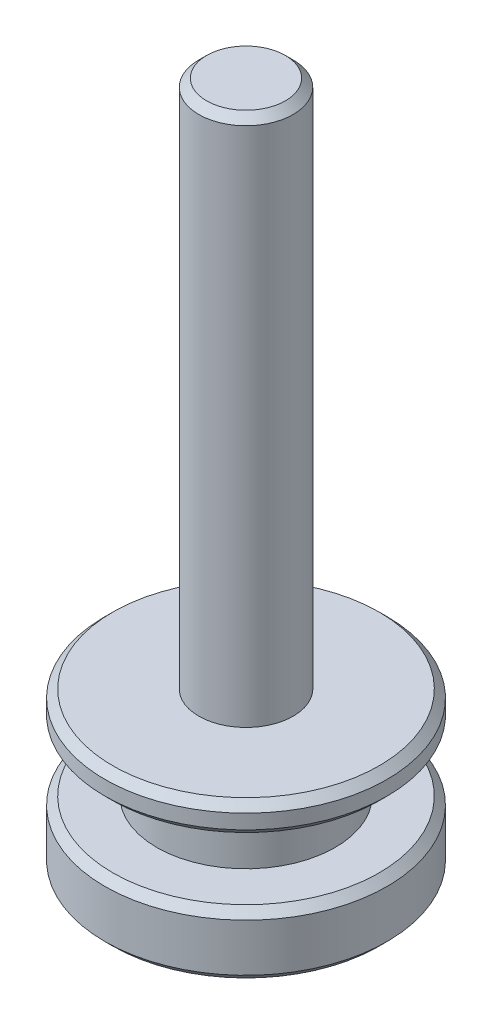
ISO-10303-21;
HEADER;
FILE_DESCRIPTION(('STEP AP214'),'2;1');
FILE_NAME('part.step','',(''),(''),'','','');
FILE_SCHEMA(('AUTOMOTIVE_DESIGN { 1 0 10303 214 1 1 1 1 }'));
ENDSEC;
DATA;
#1=APPLICATION_CONTEXT('core data for automotive mechanical design processes');
#2=APPLICATION_PROTOCOL_DEFINITION('international standard','automotive_design',2000,#1);
#3=PRODUCT_CONTEXT('',#1,'mechanical');
#4=PRODUCT('Part','Part','',(#3));
#5=PRODUCT_RELATED_PRODUCT_CATEGORY('part','',(#4));
#6=PRODUCT_DEFINITION_FORMATION('','',#4);
#7=PRODUCT_DEFINITION_CONTEXT('part definition',#1,'design');
#8=PRODUCT_DEFINITION('design','',#6,#7);
#9=PRODUCT_DEFINITION_SHAPE('','',#8);
#10=(LENGTH_UNIT() NAMED_UNIT(*) SI_UNIT(.MILLI.,.METRE.));
#11=(NAMED_UNIT(*) PLANE_ANGLE_UNIT() SI_UNIT($,.RADIAN.));
#12=(NAMED_UNIT(*) SI_UNIT($,.STERADIAN.) SOLID_ANGLE_UNIT());
#13=UNCERTAINTY_MEASURE_WITH_UNIT(LENGTH_MEASURE(1.E-05),#10,'distance_accuracy_value','');
#14=(GEOMETRIC_REPRESENTATION_CONTEXT(3) GLOBAL_UNCERTAINTY_ASSIGNED_CONTEXT((#13)) GLOBAL_UNIT_ASSIGNED_CONTEXT((#10,
#11,#12)) REPRESENTATION_CONTEXT('',''));
#15=CARTESIAN_POINT('',(0.,0.,0.));
#16=DIRECTION('',(0.,0.,1.));
#17=DIRECTION('',(1.,0.,0.));
#18=AXIS2_PLACEMENT_3D('',#15,#16,#17);
#19=CARTESIAN_POINT('',(0.,7.874,0.));
#20=DIRECTION('',(0.,1.,0.));
#21=DIRECTION('',(0.,0.,1.));
#22=AXIS2_PLACEMENT_3D('',#19,#20,#21);
#23=PLANE('',#22);
#24=CARTESIAN_POINT('',(0.,7.874,0.));
#25=DIRECTION('',(0.,1.,0.));
#26=DIRECTION('',(0.,0.,1.));
#27=AXIS2_PLACEMENT_3D('',#24,#25,#26);
#28=CIRCLE('',#27,6.71512500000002);
#29=CARTESIAN_POINT('',(0.,7.874,-6.71512500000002));
#30=VERTEX_POINT('',#29);
#31=EDGE_CURVE('E41',#30,#30,#28,.T.);
#32=ORIENTED_EDGE('',*,*,#31,.T.);
#33=EDGE_LOOP('',(#32));
#34=FACE_BOUND('',#33,.T.);
#35=CARTESIAN_POINT('',(0.,7.874,0.));
#36=DIRECTION('',(0.,1.,0.));
#37=DIRECTION('',(0.,0.,1.));
#38=AXIS2_PLACEMENT_3D('',#35,#36,#37);
#39=CIRCLE('',#38,2.38125);
#40=CARTESIAN_POINT('',(0.,7.874,2.38125));
#41=VERTEX_POINT('',#40);
#42=EDGE_CURVE('E72',#41,#41,#39,.T.);
#43=ORIENTED_EDGE('',*,*,#42,.F.);
#44=EDGE_LOOP('',(#43));
#45=FACE_BOUND('',#44,.T.);
#46=ADVANCED_FACE('F30',(#34,#45),#23,.T.);
#47=CARTESIAN_POINT('',(0.,3.2004,0.));
#48=DIRECTION('',(0.,1.,0.));
#49=DIRECTION('',(0.,0.,1.));
#50=AXIS2_PLACEMENT_3D('',#47,#48,#49);
#51=PLANE('',#50);
#52=CARTESIAN_POINT('',(0.,3.2004,0.));
#53=DIRECTION('',(0.,1.,0.));
#54=DIRECTION('',(0.,0.,1.));
#55=AXIS2_PLACEMENT_3D('',#52,#53,#54);
#56=CIRCLE('',#55,6.71512500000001);
#57=CARTESIAN_POINT('',(0.,3.2004,6.71512500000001));
#58=VERTEX_POINT('',#57);
#59=EDGE_CURVE('E56',#58,#58,#56,.T.);
#60=ORIENTED_EDGE('',*,*,#59,.T.);
#61=EDGE_LOOP('',(#60));
#62=FACE_BOUND('',#61,.T.);
#63=CARTESIAN_POINT('',(0.,3.2004,0.));
#64=DIRECTION('',(0.,1.,0.));
#65=DIRECTION('',(0.,0.,1.));
#66=AXIS2_PLACEMENT_3D('',#63,#64,#65);
#67=CIRCLE('',#66,4.5);
#68=CARTESIAN_POINT('',(0.,3.2004,4.5));
#69=VERTEX_POINT('',#68);
#70=EDGE_CURVE('E69',#69,#69,#67,.T.);
#71=ORIENTED_EDGE('',*,*,#70,.F.);
#72=EDGE_LOOP('',(#71));
#73=FACE_BOUND('',#72,.T.);
#74=ADVANCED_FACE('F81',(#62,#73),#51,.T.);
#75=CARTESIAN_POINT('',(0.,3.2004,0.));
#76=DIRECTION('',(0.,-1.,0.));
#77=DIRECTION('',(0.,0.,-1.));
#78=AXIS2_PLACEMENT_3D('',#75,#76,#77);
#79=CYLINDRICAL_SURFACE('',#78,7.112);
#80=CARTESIAN_POINT('',(0.,0.396874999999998,0.));
#81=DIRECTION('',(0.,1.,0.));
#82=DIRECTION('',(0.,0.,1.));
#83=AXIS2_PLACEMENT_3D('',#80,#81,#82);
#84=CIRCLE('',#83,7.112);
#85=CARTESIAN_POINT('',(0.,0.396874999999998,7.112));
#86=VERTEX_POINT('',#85);
#87=EDGE_CURVE('E62',#86,#86,#84,.T.);
#88=ORIENTED_EDGE('',*,*,#87,.T.);
#89=EDGE_LOOP('',(#88));
#90=FACE_BOUND('',#89,.T.);
#91=CARTESIAN_POINT('',(0.,2.803525,0.));
#92=DIRECTION('',(0.,1.,0.));
#93=DIRECTION('',(0.,0.,1.));
#94=AXIS2_PLACEMENT_3D('',#91,#92,#93);
#95=CIRCLE('',#94,7.112);
#96=CARTESIAN_POINT('',(0.,2.803525,7.112));
#97=VERTEX_POINT('',#96);
#98=EDGE_CURVE('E65',#97,#97,#95,.F.);
#99=ORIENTED_EDGE('',*,*,#98,.T.);
#100=EDGE_LOOP('',(#99));
#101=FACE_BOUND('',#100,.T.);
#102=ADVANCED_FACE('F87',(#90,#101),#79,.T.);
#103=CARTESIAN_POINT('',(0.,0.,0.));
#104=DIRECTION('',(0.,1.,0.));
#105=DIRECTION('',(0.,0.,1.));
#106=AXIS2_PLACEMENT_3D('',#103,#104,#105);
#107=PLANE('',#106);
#108=CARTESIAN_POINT('',(0.,0.,0.));
#109=DIRECTION('',(0.,1.,0.));
#110=DIRECTION('',(0.,0.,1.));
#111=AXIS2_PLACEMENT_3D('',#108,#109,#110);
#112=CIRCLE('',#111,6.715125);
#113=CARTESIAN_POINT('',(0.,0.,6.715125));
#114=VERTEX_POINT('',#113);
#115=EDGE_CURVE('E59',#114,#114,#112,.F.);
#116=ORIENTED_EDGE('',*,*,#115,.T.);
#117=EDGE_LOOP('',(#116));
#118=FACE_BOUND('',#117,.T.);
#119=ADVANCED_FACE('F103',(#118),#107,.F.);
#120=CARTESIAN_POINT('',(0.,6.35,0.));
#121=DIRECTION('',(0.,-1.,0.));
#122=DIRECTION('',(0.,0.,-1.));
#123=AXIS2_PLACEMENT_3D('',#120,#121,#122);
#124=CYLINDRICAL_SURFACE('',#123,4.5);
#125=CARTESIAN_POINT('',(0.,6.35,0.));
#126=DIRECTION('',(0.,1.,0.));
#127=DIRECTION('',(0.,0.,1.));
#128=AXIS2_PLACEMENT_3D('',#125,#126,#127);
#129=CIRCLE('',#128,4.5);
#130=CARTESIAN_POINT('',(0.,6.35,4.5));
#131=VERTEX_POINT('',#130);
#132=EDGE_CURVE('E68',#131,#131,#129,.T.);
#133=ORIENTED_EDGE('',*,*,#132,.F.);
#134=EDGE_LOOP('',(#133));
#135=FACE_BOUND('',#134,.T.);
#136=ORIENTED_EDGE('',*,*,#70,.T.);
#137=EDGE_LOOP('',(#136));
#138=FACE_BOUND('',#137,.T.);
#139=ADVANCED_FACE('F97',(#135,#138),#124,.T.);
#140=CARTESIAN_POINT('',(0.,6.35,0.));
#141=DIRECTION('',(0.,1.,0.));
#142=DIRECTION('',(0.,0.,1.));
#143=AXIS2_PLACEMENT_3D('',#140,#141,#142);
#144=PLANE('',#143);
#145=CARTESIAN_POINT('',(0.,6.35,0.));
#146=DIRECTION('',(0.,1.,0.));
#147=DIRECTION('',(0.,0.,1.));
#148=AXIS2_PLACEMENT_3D('',#145,#146,#147);
#149=CIRCLE('',#148,6.71512499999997);
#150=CARTESIAN_POINT('',(0.,6.35,6.71512499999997));
#151=VERTEX_POINT('',#150);
#152=EDGE_CURVE('E45',#151,#151,#149,.F.);
#153=ORIENTED_EDGE('',*,*,#152,.T.);
#154=EDGE_LOOP('',(#153));
#155=FACE_BOUND('',#154,.T.);
#156=ORIENTED_EDGE('',*,*,#132,.T.);
#157=EDGE_LOOP('',(#156));
#158=FACE_BOUND('',#157,.T.);
#159=ADVANCED_FACE('F93',(#155,#158),#144,.F.);
#160=CARTESIAN_POINT('',(0.,7.874,0.));
#161=DIRECTION('',(0.,-1.,0.));
#162=DIRECTION('',(0.,0.,-1.));
#163=AXIS2_PLACEMENT_3D('',#160,#161,#162);
#164=CYLINDRICAL_SURFACE('',#163,7.112);
#165=CARTESIAN_POINT('',(0.,6.74687500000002,0.));
#166=DIRECTION('',(0.,1.,0.));
#167=DIRECTION('',(0.,0.,1.));
#168=AXIS2_PLACEMENT_3D('',#165,#166,#167);
#169=CIRCLE('',#168,7.112);
#170=CARTESIAN_POINT('',(0.,6.74687500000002,-7.112));
#171=VERTEX_POINT('',#170);
#172=EDGE_CURVE('E50',#171,#171,#169,.T.);
#173=CARTESIAN_POINT('',(0.,7.47712500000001,0.));
#174=DIRECTION('',(0.,1.,0.));
#175=DIRECTION('',(0.,0.,1.));
#176=AXIS2_PLACEMENT_3D('',#173,#174,#175);
#177=CIRCLE('',#176,7.112);
#178=CARTESIAN_POINT('',(0.,7.47712500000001,-7.112));
#179=VERTEX_POINT('',#178);
#180=EDGE_CURVE('E53',#179,#179,#177,.F.);
#181=CARTESIAN_POINT('',(0.,6.74687500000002,-7.112));
#182=CARTESIAN_POINT('',(0.,6.75448177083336,-7.112));
#183=CARTESIAN_POINT('',(0.,6.76208854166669,-7.112));
#184=CARTESIAN_POINT('',(0.,6.77730208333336,-7.112));
#185=CARTESIAN_POINT('',(0.,6.78490885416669,-7.112));
#186=CARTESIAN_POINT('',(0.,6.80012239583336,-7.112));
#187=CARTESIAN_POINT('',(0.,6.80772916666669,-7.112));
#188=CARTESIAN_POINT('',(0.,6.82294270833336,-7.112));
#189=CARTESIAN_POINT('',(0.,6.83054947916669,-7.112));
#190=CARTESIAN_POINT('',(0.,6.84576302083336,-7.112));
#191=CARTESIAN_POINT('',(0.,6.85336979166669,-7.112));
#192=CARTESIAN_POINT('',(0.,6.86858333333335,-7.112));
#193=CARTESIAN_POINT('',(0.,6.87619010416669,-7.112));
#194=CARTESIAN_POINT('',(0.,6.89140364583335,-7.112));
#195=CARTESIAN_POINT('',(0.,6.89901041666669,-7.112));
#196=CARTESIAN_POINT('',(0.,6.91422395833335,-7.112));
#197=CARTESIAN_POINT('',(0.,6.92183072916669,-7.112));
#198=CARTESIAN_POINT('',(0.,6.93704427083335,-7.112));
#199=CARTESIAN_POINT('',(0.,6.94465104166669,-7.112));
#200=CARTESIAN_POINT('',(0.,6.95986458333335,-7.112));
#201=CARTESIAN_POINT('',(0.,6.96747135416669,-7.112));
#202=CARTESIAN_POINT('',(0.,6.98268489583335,-7.112));
#203=CARTESIAN_POINT('',(0.,6.99029166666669,-7.112));
#204=CARTESIAN_POINT('',(0.,7.00550520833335,-7.112));
#205=CARTESIAN_POINT('',(0.,7.01311197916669,-7.112));
#206=CARTESIAN_POINT('',(0.,7.02832552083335,-7.112));
#207=CARTESIAN_POINT('',(0.,7.03593229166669,-7.112));
#208=CARTESIAN_POINT('',(0.,7.05114583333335,-7.112));
#209=CARTESIAN_POINT('',(0.,7.05875260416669,-7.112));
#210=CARTESIAN_POINT('',(0.,7.07396614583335,-7.112));
#211=CARTESIAN_POINT('',(0.,7.08157291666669,-7.112));
#212=CARTESIAN_POINT('',(0.,7.09678645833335,-7.112));
#213=CARTESIAN_POINT('',(0.,7.10439322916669,-7.112));
#214=CARTESIAN_POINT('',(0.,7.11960677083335,-7.112));
#215=CARTESIAN_POINT('',(0.,7.12721354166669,-7.112));
#216=CARTESIAN_POINT('',(0.,7.14242708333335,-7.112));
#217=CARTESIAN_POINT('',(0.,7.15003385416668,-7.112));
#218=CARTESIAN_POINT('',(0.,7.16524739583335,-7.112));
#219=CARTESIAN_POINT('',(0.,7.17285416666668,-7.112));
#220=CARTESIAN_POINT('',(0.,7.18806770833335,-7.112));
#221=CARTESIAN_POINT('',(0.,7.19567447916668,-7.112));
#222=CARTESIAN_POINT('',(0.,7.21088802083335,-7.112));
#223=CARTESIAN_POINT('',(0.,7.21849479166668,-7.112));
#224=CARTESIAN_POINT('',(0.,7.23370833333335,-7.112));
#225=CARTESIAN_POINT('',(0.,7.24131510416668,-7.112));
#226=CARTESIAN_POINT('',(0.,7.25652864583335,-7.112));
#227=CARTESIAN_POINT('',(0.,7.26413541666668,-7.112));
#228=CARTESIAN_POINT('',(0.,7.27934895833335,-7.112));
#229=CARTESIAN_POINT('',(0.,7.28695572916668,-7.112));
#230=CARTESIAN_POINT('',(0.,7.30216927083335,-7.112));
#231=CARTESIAN_POINT('',(0.,7.30977604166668,-7.112));
#232=CARTESIAN_POINT('',(0.,7.32498958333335,-7.112));
#233=CARTESIAN_POINT('',(0.,7.33259635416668,-7.112));
#234=CARTESIAN_POINT('',(0.,7.34780989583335,-7.112));
#235=CARTESIAN_POINT('',(0.,7.35541666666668,-7.112));
#236=CARTESIAN_POINT('',(0.,7.37063020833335,-7.112));
#237=CARTESIAN_POINT('',(0.,7.37823697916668,-7.112));
#238=CARTESIAN_POINT('',(0.,7.39345052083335,-7.112));
#239=CARTESIAN_POINT('',(0.,7.40105729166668,-7.112));
#240=CARTESIAN_POINT('',(0.,7.41627083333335,-7.112));
#241=CARTESIAN_POINT('',(0.,7.42387760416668,-7.112));
#242=CARTESIAN_POINT('',(0.,7.43909114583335,-7.112));
#243=CARTESIAN_POINT('',(0.,7.44669791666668,-7.112));
#244=CARTESIAN_POINT('',(0.,7.46191145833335,-7.112));
#245=CARTESIAN_POINT('',(0.,7.46951822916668,-7.112));
#246=CARTESIAN_POINT('',(0.,7.47712500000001,-7.112));
#247=B_SPLINE_CURVE_WITH_KNOTS('',3,(#181,#182,#183,#184,#185,#186,#187,#188,#189,#190,#191,
#192,#193,#194,#195,#196,#197,#198,#199,#200,#201,#202,#203,#204,#205,#206,#207,#208,#209,#210,
#211,#212,#213,#214,#215,#216,#217,#218,#219,#220,#221,#222,#223,#224,#225,#226,#227,#228,#229,
#230,#231,#232,#233,#234,#235,#236,#237,#238,#239,#240,#241,#242,#243,#244,#245,#246),
.UNSPECIFIED.,.F.,.F.,(4,2,2,2,2,2,2,2,2,2,2,2,2,2,2,2,2,2,2,2,2,2,2,2,2,2,2,2,2,2,2,2,4),(0.,
0.0228203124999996,0.0456406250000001,0.0684609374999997,0.0912812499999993,0.114101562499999,
0.136921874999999,0.159742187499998,0.182562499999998,0.205382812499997,0.228203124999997,
0.251023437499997,0.273843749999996,0.296664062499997,0.319484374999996,0.342304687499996,
0.365124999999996,0.387945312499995,0.410765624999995,0.433585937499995,0.456406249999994,
0.479226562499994,0.502046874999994,0.524867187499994,0.547687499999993,0.570507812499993,
0.593328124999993,0.616148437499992,0.638968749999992,0.661789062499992,0.684609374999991,
0.707429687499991,0.730249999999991),.UNSPECIFIED.);
#248=EDGE_CURVE('BSEAM96',#171,#179,#247,.T.);
#249=ORIENTED_EDGE('',*,*,#172,.T.);
#250=ORIENTED_EDGE('',*,*,#180,.T.);
#251=ORIENTED_EDGE('',*,*,#248,.T.);
#252=ORIENTED_EDGE('',*,*,#248,.F.);
#253=EDGE_LOOP('',(#249,#251,#250,#252));
#254=FACE_BOUND('',#253,.T.);
#255=ADVANCED_FACE('F96',(#254),#164,.T.);
#256=CARTESIAN_POINT('',(0.,34.544,0.));
#257=DIRECTION('',(0.,-1.,0.));
#258=DIRECTION('',(0.,0.,-1.));
#259=AXIS2_PLACEMENT_3D('',#256,#257,#258);
#260=CYLINDRICAL_SURFACE('',#259,2.38125);
#261=CARTESIAN_POINT('',(0.,34.147125,0.));
#262=DIRECTION('',(0.,1.,0.));
#263=DIRECTION('',(0.,0.,1.));
#264=AXIS2_PLACEMENT_3D('',#261,#262,#263);
#265=CIRCLE('',#264,2.38125);
#266=CARTESIAN_POINT('',(0.,34.147125,2.38125));
#267=VERTEX_POINT('',#266);
#268=EDGE_CURVE('E10',#267,#267,#265,.F.);
#269=ORIENTED_EDGE('',*,*,#268,.T.);
#270=EDGE_LOOP('',(#269));
#271=FACE_BOUND('',#270,.T.);
#272=ORIENTED_EDGE('',*,*,#42,.T.);
#273=EDGE_LOOP('',(#272));
#274=FACE_BOUND('',#273,.T.);
#275=ADVANCED_FACE('F78',(#271,#274),#260,.T.);
#276=CARTESIAN_POINT('',(0.,34.544,0.));
#277=DIRECTION('',(0.,1.,0.));
#278=DIRECTION('',(0.,0.,1.));
#279=AXIS2_PLACEMENT_3D('',#276,#277,#278);
#280=PLANE('',#279);
#281=CARTESIAN_POINT('',(0.,34.544,0.));
#282=DIRECTION('',(0.,1.,0.));
#283=DIRECTION('',(0.,0.,1.));
#284=AXIS2_PLACEMENT_3D('',#281,#282,#283);
#285=CIRCLE('',#284,1.98437500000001);
#286=CARTESIAN_POINT('',(0.,34.544,1.98437500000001));
#287=VERTEX_POINT('',#286);
#288=EDGE_CURVE('E37',#287,#287,#285,.T.);
#289=ORIENTED_EDGE('',*,*,#288,.T.);
#290=EDGE_LOOP('',(#289));
#291=FACE_BOUND('',#290,.T.);
#292=ADVANCED_FACE('F116',(#291),#280,.T.);
#293=CARTESIAN_POINT('',(0.,0.396874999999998,0.));
#294=DIRECTION('',(0.,1.,0.));
#295=DIRECTION('',(0.,0.,1.));
#296=AXIS2_PLACEMENT_3D('',#293,#294,#295);
#297=CONICAL_SURFACE('',#296,7.112,0.785398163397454);
#298=ORIENTED_EDGE('',*,*,#115,.F.);
#299=EDGE_LOOP('',(#298));
#300=FACE_BOUND('',#299,.T.);
#301=ORIENTED_EDGE('',*,*,#87,.F.);
#302=EDGE_LOOP('',(#301));
#303=FACE_BOUND('',#302,.T.);
#304=ADVANCED_FACE('F112',(#300,#303),#297,.T.);
#305=CARTESIAN_POINT('',(0.,3.2004,0.));
#306=DIRECTION('',(0.,-1.,0.));
#307=DIRECTION('',(0.,0.,-1.));
#308=AXIS2_PLACEMENT_3D('',#305,#306,#307);
#309=CONICAL_SURFACE('',#308,6.71512500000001,0.785398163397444);
#310=ORIENTED_EDGE('',*,*,#98,.F.);
#311=EDGE_LOOP('',(#310));
#312=FACE_BOUND('',#311,.T.);
#313=ORIENTED_EDGE('',*,*,#59,.F.);
#314=EDGE_LOOP('',(#313));
#315=FACE_BOUND('',#314,.T.);
#316=ADVANCED_FACE('F115',(#312,#315),#309,.T.);
#317=CARTESIAN_POINT('',(0.,6.74687500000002,0.));
#318=DIRECTION('',(0.,1.,0.));
#319=DIRECTION('',(0.,0.,1.));
#320=AXIS2_PLACEMENT_3D('',#317,#318,#319);
#321=CONICAL_SURFACE('',#320,7.112,0.785398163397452);
#322=ORIENTED_EDGE('',*,*,#152,.F.);
#323=EDGE_LOOP('',(#322));
#324=FACE_BOUND('',#323,.T.);
#325=ORIENTED_EDGE('',*,*,#172,.F.);
#326=EDGE_LOOP('',(#325));
#327=FACE_BOUND('',#326,.T.);
#328=ADVANCED_FACE('F120',(#324,#327),#321,.T.);
#329=CARTESIAN_POINT('',(0.,7.874,0.));
#330=DIRECTION('',(0.,-1.,0.));
#331=DIRECTION('',(0.,0.,-1.));
#332=AXIS2_PLACEMENT_3D('',#329,#330,#331);
#333=CONICAL_SURFACE('',#332,6.71512500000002,0.785398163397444);
#334=CARTESIAN_POINT('',(0.,7.47712500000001,-7.112));
#335=CARTESIAN_POINT('',(0.,7.48125911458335,-7.10786588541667));
#336=CARTESIAN_POINT('',(0.,7.48539322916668,-7.10373177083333));
#337=CARTESIAN_POINT('',(0.,7.49366145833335,-7.09546354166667));
#338=CARTESIAN_POINT('',(0.,7.49779557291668,-7.09132942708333));
#339=CARTESIAN_POINT('',(0.,7.50606380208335,-7.08306119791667));
#340=CARTESIAN_POINT('',(0.,7.51019791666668,-7.07892708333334));
#341=CARTESIAN_POINT('',(0.,7.51846614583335,-7.07065885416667));
#342=CARTESIAN_POINT('',(0.,7.52260026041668,-7.06652473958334));
#343=CARTESIAN_POINT('',(0.,7.53086848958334,-7.05825651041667));
#344=CARTESIAN_POINT('',(0.,7.53500260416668,-7.05412239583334));
#345=CARTESIAN_POINT('',(0.,7.54327083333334,-7.04585416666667));
#346=CARTESIAN_POINT('',(0.,7.54740494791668,-7.04172005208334));
#347=CARTESIAN_POINT('',(0.,7.55567317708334,-7.03345182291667));
#348=CARTESIAN_POINT('',(0.,7.55980729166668,-7.02931770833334));
#349=CARTESIAN_POINT('',(0.,7.56807552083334,-7.02104947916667));
#350=CARTESIAN_POINT('',(0.,7.57220963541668,-7.01691536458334));
#351=CARTESIAN_POINT('',(0.,7.58047786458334,-7.00864713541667));
#352=CARTESIAN_POINT('',(0.,7.58461197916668,-7.00451302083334));
#353=CARTESIAN_POINT('',(0.,7.59288020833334,-6.99624479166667));
#354=CARTESIAN_POINT('',(0.,7.59701432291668,-6.99211067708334));
#355=CARTESIAN_POINT('',(0.,7.60528255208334,-6.98384244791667));
#356=CARTESIAN_POINT('',(0.,7.60941666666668,-6.97970833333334));
#357=CARTESIAN_POINT('',(0.,7.61768489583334,-6.97144010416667));
#358=CARTESIAN_POINT('',(0.,7.62181901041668,-6.96730598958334));
#359=CARTESIAN_POINT('',(0.,7.63008723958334,-6.95903776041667));
#360=CARTESIAN_POINT('',(0.,7.63422135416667,-6.95490364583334));
#361=CARTESIAN_POINT('',(0.,7.64248958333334,-6.94663541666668));
#362=CARTESIAN_POINT('',(0.,7.64662369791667,-6.94250130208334));
#363=CARTESIAN_POINT('',(0.,7.65489192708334,-6.93423307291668));
#364=CARTESIAN_POINT('',(0.,7.65902604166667,-6.93009895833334));
#365=CARTESIAN_POINT('',(0.,7.66729427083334,-6.92183072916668));
#366=CARTESIAN_POINT('',(0.,7.67142838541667,-6.91769661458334));
#367=CARTESIAN_POINT('',(0.,7.67969661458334,-6.90942838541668));
#368=CARTESIAN_POINT('',(0.,7.68383072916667,-6.90529427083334));
#369=CARTESIAN_POINT('',(0.,7.69209895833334,-6.89702604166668));
#370=CARTESIAN_POINT('',(0.,7.69623307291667,-6.89289192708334));
#371=CARTESIAN_POINT('',(0.,7.70450130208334,-6.88462369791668));
#372=CARTESIAN_POINT('',(0.,7.70863541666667,-6.88048958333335));
#373=CARTESIAN_POINT('',(0.,7.71690364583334,-6.87222135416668));
#374=CARTESIAN_POINT('',(0.,7.72103776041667,-6.86808723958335));
#375=CARTESIAN_POINT('',(0.,7.72930598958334,-6.85981901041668));
#376=CARTESIAN_POINT('',(0.,7.73344010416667,-6.85568489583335));
#377=CARTESIAN_POINT('',(0.,7.74170833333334,-6.84741666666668));
#378=CARTESIAN_POINT('',(0.,7.74584244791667,-6.84328255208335));
#379=CARTESIAN_POINT('',(0.,7.75411067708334,-6.83501432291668));
#380=CARTESIAN_POINT('',(0.,7.75824479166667,-6.83088020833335));
#381=CARTESIAN_POINT('',(0.,7.76651302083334,-6.82261197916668));
#382=CARTESIAN_POINT('',(0.,7.77064713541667,-6.81847786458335));
#383=CARTESIAN_POINT('',(0.,7.77891536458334,-6.81020963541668));
#384=CARTESIAN_POINT('',(0.,7.78304947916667,-6.80607552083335));
#385=CARTESIAN_POINT('',(0.,7.79131770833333,-6.79780729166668));
#386=CARTESIAN_POINT('',(0.,7.79545182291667,-6.79367317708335));
#387=CARTESIAN_POINT('',(0.,7.80372005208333,-6.78540494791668));
#388=CARTESIAN_POINT('',(0.,7.80785416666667,-6.78127083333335));
#389=CARTESIAN_POINT('',(0.,7.81612239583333,-6.77300260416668));
#390=CARTESIAN_POINT('',(0.,7.82025651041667,-6.76886848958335));
#391=CARTESIAN_POINT('',(0.,7.82852473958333,-6.76060026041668));
#392=CARTESIAN_POINT('',(0.,7.83265885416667,-6.75646614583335));
#393=CARTESIAN_POINT('',(0.,7.84092708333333,-6.74819791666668));
#394=CARTESIAN_POINT('',(0.,7.84506119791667,-6.74406380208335));
#395=CARTESIAN_POINT('',(0.,7.85332942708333,-6.73579557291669));
#396=CARTESIAN_POINT('',(0.,7.85746354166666,-6.73166145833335));
#397=CARTESIAN_POINT('',(0.,7.86573177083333,-6.72339322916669));
#398=CARTESIAN_POINT('',(0.,7.86986588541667,-6.71925911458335));
#399=CARTESIAN_POINT('',(0.,7.874,-6.71512500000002));
#400=B_SPLINE_CURVE_WITH_KNOTS('',3,(#334,#335,#336,#337,#338,#339,#340,#341,#342,#343,#344,
#345,#346,#347,#348,#349,#350,#351,#352,#353,#354,#355,#356,#357,#358,#359,#360,#361,#362,#363,
#364,#365,#366,#367,#368,#369,#370,#371,#372,#373,#374,#375,#376,#377,#378,#379,#380,#381,#382,
#383,#384,#385,#386,#387,#388,#389,#390,#391,#392,#393,#394,#395,#396,#397,#398,#399),
.UNSPECIFIED.,.F.,.F.,(4,2,2,2,2,2,2,2,2,2,2,2,2,2,2,2,2,2,2,2,2,2,2,2,2,2,2,2,2,2,2,2,4),(0.,
0.0175395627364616,0.0350791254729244,0.0526186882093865,0.0701582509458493,0.0876978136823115,
0.105237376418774,0.122776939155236,0.140316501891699,0.157856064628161,0.175395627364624,
0.192935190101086,0.210474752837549,0.228014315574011,0.245553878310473,0.263093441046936,
0.280633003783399,0.298172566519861,0.315712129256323,0.333251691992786,0.350791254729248,
0.368330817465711,0.385870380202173,0.403409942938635,0.420949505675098,0.438489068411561,
0.456028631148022,0.473568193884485,0.491107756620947,0.508647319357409,0.526186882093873,
0.543726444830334,0.561266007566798),.UNSPECIFIED.);
#401=EDGE_CURVE('BSEAM123',#179,#30,#400,.T.);
#402=ORIENTED_EDGE('',*,*,#180,.F.);
#403=ORIENTED_EDGE('',*,*,#31,.F.);
#404=ORIENTED_EDGE('',*,*,#401,.T.);
#405=ORIENTED_EDGE('',*,*,#401,.F.);
#406=EDGE_LOOP('',(#402,#404,#403,#405));
#407=FACE_BOUND('',#406,.T.);
#408=ADVANCED_FACE('F123',(#407),#333,.T.);
#409=CARTESIAN_POINT('',(0.,34.544,0.));
#410=DIRECTION('',(0.,-1.,0.));
#411=DIRECTION('',(0.,0.,-1.));
#412=AXIS2_PLACEMENT_3D('',#409,#410,#411);
#413=CONICAL_SURFACE('',#412,1.98437500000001,0.785398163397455);
#414=ORIENTED_EDGE('',*,*,#268,.F.);
#415=EDGE_LOOP('',(#414));
#416=FACE_BOUND('',#415,.T.);
#417=ORIENTED_EDGE('',*,*,#288,.F.);
#418=EDGE_LOOP('',(#417));
#419=FACE_BOUND('',#418,.T.);
#420=ADVANCED_FACE('F32',(#416,#419),#413,.T.);
#421=CLOSED_SHELL('',(#46,#74,#102,#119,#139,#159,#255,#275,#292,#304,#316,#328,#408,#420));
#422=MANIFOLD_SOLID_BREP('B2',#421);
#423=ADVANCED_BREP_SHAPE_REPRESENTATION('',(#18,#422),#14);
#424=SHAPE_DEFINITION_REPRESENTATION(#9,#423);
ENDSEC;
END-ISO-10303-21;
